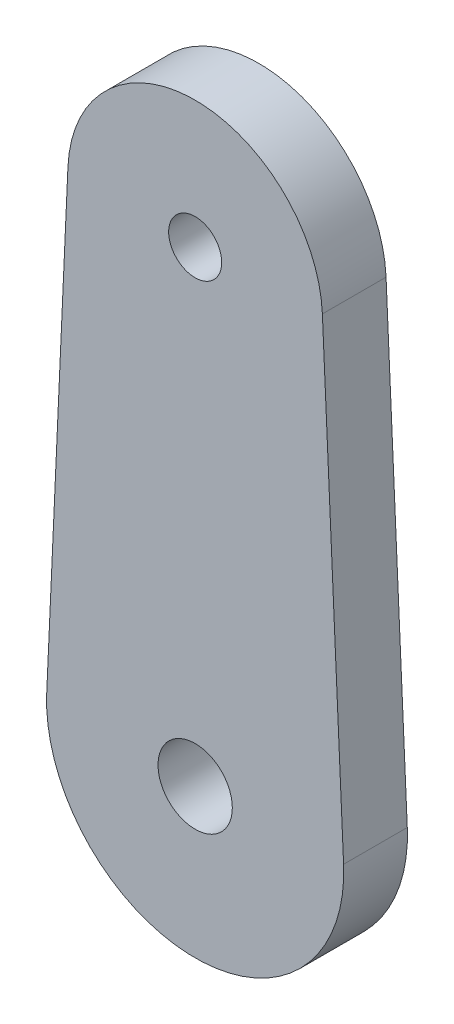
ISO-10303-21;
HEADER;
FILE_DESCRIPTION(('STEP AP214'),'2;1');
FILE_NAME('part.step','',(''),(''),'','','');
FILE_SCHEMA(('AUTOMOTIVE_DESIGN { 1 0 10303 214 1 1 1 1 }'));
ENDSEC;
DATA;
#1=APPLICATION_CONTEXT('core data for automotive mechanical design processes');
#2=APPLICATION_PROTOCOL_DEFINITION('international standard','automotive_design',2000,#1);
#3=PRODUCT_CONTEXT('',#1,'mechanical');
#4=PRODUCT('Part','Part','',(#3));
#5=PRODUCT_RELATED_PRODUCT_CATEGORY('part','',(#4));
#6=PRODUCT_DEFINITION_FORMATION('','',#4);
#7=PRODUCT_DEFINITION_CONTEXT('part definition',#1,'design');
#8=PRODUCT_DEFINITION('design','',#6,#7);
#9=PRODUCT_DEFINITION_SHAPE('','',#8);
#10=(LENGTH_UNIT() NAMED_UNIT(*) SI_UNIT(.MILLI.,.METRE.));
#11=(NAMED_UNIT(*) PLANE_ANGLE_UNIT() SI_UNIT($,.RADIAN.));
#12=(NAMED_UNIT(*) SI_UNIT($,.STERADIAN.) SOLID_ANGLE_UNIT());
#13=UNCERTAINTY_MEASURE_WITH_UNIT(LENGTH_MEASURE(1.E-05),#10,'distance_accuracy_value','');
#14=(GEOMETRIC_REPRESENTATION_CONTEXT(3) GLOBAL_UNCERTAINTY_ASSIGNED_CONTEXT((#13)) GLOBAL_UNIT_ASSIGNED_CONTEXT((#10,
#11,#12)) REPRESENTATION_CONTEXT('',''));
#15=CARTESIAN_POINT('',(0.,0.,0.));
#16=DIRECTION('',(0.,0.,1.));
#17=DIRECTION('',(1.,0.,0.));
#18=AXIS2_PLACEMENT_3D('',#15,#16,#17);
#19=CARTESIAN_POINT('',(0.,22.,3.));
#20=DIRECTION('',(0.,0.,1.));
#21=DIRECTION('',(1.,0.,0.));
#22=AXIS2_PLACEMENT_3D('',#19,#20,#21);
#23=PLANE('',#22);
#24=CARTESIAN_POINT('',(0.,22.,3.));
#25=DIRECTION('',(0.,0.,1.));
#26=DIRECTION('',(1.,0.,0.));
#27=AXIS2_PLACEMENT_3D('',#24,#25,#26);
#28=CIRCLE('',#27,1.24999999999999);
#29=CARTESIAN_POINT('',(1.24999999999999,22.,3.));
#30=VERTEX_POINT('',#29);
#31=EDGE_CURVE('E117',#30,#30,#28,.T.);
#32=ORIENTED_EDGE('',*,*,#31,.F.);
#33=EDGE_LOOP('',(#32));
#34=FACE_BOUND('',#33,.T.);
#35=CARTESIAN_POINT('',(0.,22.,3.));
#36=DIRECTION('',(0.,0.,1.));
#37=DIRECTION('',(1.,0.,0.));
#38=AXIS2_PLACEMENT_3D('',#35,#36,#37);
#39=CIRCLE('',#38,6.);
#40=CARTESIAN_POINT('',(5.99379844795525,22.2727272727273,3.));
#41=VERTEX_POINT('',#40);
#42=CARTESIAN_POINT('',(-5.99379844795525,22.2727272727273,3.));
#43=VERTEX_POINT('',#42);
#44=EDGE_CURVE('E82',#41,#43,#39,.T.);
#45=ORIENTED_EDGE('',*,*,#44,.T.);
#46=DIRECTION('',(-0.0454545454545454,-0.998966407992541,0.));
#47=VECTOR('',#46,1.);
#48=CARTESIAN_POINT('',(-5.99379844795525,22.2727272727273,3.));
#49=LINE('',#48,#47);
#50=CARTESIAN_POINT('',(-6.99276485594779,0.318181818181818,3.));
#51=VERTEX_POINT('',#50);
#52=EDGE_CURVE('E77',#43,#51,#49,.T.);
#53=ORIENTED_EDGE('',*,*,#52,.T.);
#54=CARTESIAN_POINT('',(0.,0.,3.));
#55=DIRECTION('',(0.,0.,1.));
#56=DIRECTION('',(1.,0.,0.));
#57=AXIS2_PLACEMENT_3D('',#54,#55,#56);
#58=CIRCLE('',#57,7.);
#59=CARTESIAN_POINT('',(6.99276485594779,0.318181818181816,3.));
#60=VERTEX_POINT('',#59);
#61=EDGE_CURVE('E80',#51,#60,#58,.T.);
#62=ORIENTED_EDGE('',*,*,#61,.T.);
#63=DIRECTION('',(-0.0454545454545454,0.998966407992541,0.));
#64=VECTOR('',#63,1.);
#65=CARTESIAN_POINT('',(5.99379844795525,22.2727272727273,3.));
#66=LINE('',#65,#64);
#67=EDGE_CURVE('E47',#60,#41,#66,.T.);
#68=ORIENTED_EDGE('',*,*,#67,.T.);
#69=EDGE_LOOP('',(#45,#53,#62,#68));
#70=FACE_BOUND('',#69,.T.);
#71=CARTESIAN_POINT('',(0.,0.,3.));
#72=DIRECTION('',(0.,0.,1.));
#73=DIRECTION('',(1.,0.,0.));
#74=AXIS2_PLACEMENT_3D('',#71,#72,#73);
#75=CIRCLE('',#74,1.75);
#76=CARTESIAN_POINT('',(1.75,0.,3.));
#77=VERTEX_POINT('',#76);
#78=EDGE_CURVE('E97',#77,#77,#75,.T.);
#79=ORIENTED_EDGE('',*,*,#78,.F.);
#80=EDGE_LOOP('',(#79));
#81=FACE_BOUND('',#80,.T.);
#82=ADVANCED_FACE('F30',(#34,#70,#81),#23,.T.);
#83=CARTESIAN_POINT('',(0.,22.,0.));
#84=DIRECTION('',(0.,0.,1.));
#85=DIRECTION('',(1.,0.,0.));
#86=AXIS2_PLACEMENT_3D('',#83,#84,#85);
#87=PLANE('',#86);
#88=CARTESIAN_POINT('',(0.,22.,0.));
#89=DIRECTION('',(0.,0.,1.));
#90=DIRECTION('',(1.,0.,0.));
#91=AXIS2_PLACEMENT_3D('',#88,#89,#90);
#92=CIRCLE('',#91,1.25);
#93=CARTESIAN_POINT('',(1.25,22.,0.));
#94=VERTEX_POINT('',#93);
#95=EDGE_CURVE('E112',#94,#94,#92,.T.);
#96=ORIENTED_EDGE('',*,*,#95,.T.);
#97=EDGE_LOOP('',(#96));
#98=FACE_BOUND('',#97,.T.);
#99=CARTESIAN_POINT('',(0.,22.,0.));
#100=DIRECTION('',(0.,0.,1.));
#101=DIRECTION('',(1.,0.,0.));
#102=AXIS2_PLACEMENT_3D('',#99,#100,#101);
#103=CIRCLE('',#102,6.);
#104=CARTESIAN_POINT('',(5.99379844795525,22.2727272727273,0.));
#105=VERTEX_POINT('',#104);
#106=CARTESIAN_POINT('',(-5.99379844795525,22.2727272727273,0.));
#107=VERTEX_POINT('',#106);
#108=EDGE_CURVE('E94',#105,#107,#103,.T.);
#109=ORIENTED_EDGE('',*,*,#108,.F.);
#110=DIRECTION('',(-0.0454545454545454,0.998966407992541,0.));
#111=VECTOR('',#110,1.);
#112=CARTESIAN_POINT('',(5.99379844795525,22.2727272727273,0.));
#113=LINE('',#112,#111);
#114=CARTESIAN_POINT('',(6.99276485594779,0.318181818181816,0.));
#115=VERTEX_POINT('',#114);
#116=EDGE_CURVE('E70',#115,#105,#113,.T.);
#117=ORIENTED_EDGE('',*,*,#116,.F.);
#118=CARTESIAN_POINT('',(0.,0.,0.));
#119=DIRECTION('',(0.,0.,1.));
#120=DIRECTION('',(1.,0.,0.));
#121=AXIS2_PLACEMENT_3D('',#118,#119,#120);
#122=CIRCLE('',#121,7.);
#123=CARTESIAN_POINT('',(-6.99276485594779,0.318181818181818,0.));
#124=VERTEX_POINT('',#123);
#125=EDGE_CURVE('E64',#124,#115,#122,.T.);
#126=ORIENTED_EDGE('',*,*,#125,.F.);
#127=DIRECTION('',(-0.0454545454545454,-0.998966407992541,0.));
#128=VECTOR('',#127,1.);
#129=CARTESIAN_POINT('',(-5.99379844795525,22.2727272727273,0.));
#130=LINE('',#129,#128);
#131=EDGE_CURVE('E86',#107,#124,#130,.T.);
#132=ORIENTED_EDGE('',*,*,#131,.F.);
#133=EDGE_LOOP('',(#109,#117,#126,#132));
#134=FACE_BOUND('',#133,.T.);
#135=CARTESIAN_POINT('',(0.,0.,0.));
#136=DIRECTION('',(0.,0.,1.));
#137=DIRECTION('',(1.,0.,0.));
#138=AXIS2_PLACEMENT_3D('',#135,#136,#137);
#139=CIRCLE('',#138,1.75);
#140=CARTESIAN_POINT('',(1.75,0.,0.));
#141=VERTEX_POINT('',#140);
#142=EDGE_CURVE('E109',#141,#141,#139,.T.);
#143=ORIENTED_EDGE('',*,*,#142,.T.);
#144=EDGE_LOOP('',(#143));
#145=FACE_BOUND('',#144,.T.);
#146=ADVANCED_FACE('F105',(#98,#134,#145),#87,.F.);
#147=CARTESIAN_POINT('',(0.,22.,3.));
#148=DIRECTION('',(0.,0.,-1.));
#149=DIRECTION('',(-1.,0.,0.));
#150=AXIS2_PLACEMENT_3D('',#147,#148,#149);
#151=CYLINDRICAL_SURFACE('',#150,6.);
#152=ORIENTED_EDGE('',*,*,#108,.T.);
#153=DIRECTION('',(0.,0.,-1.));
#154=VECTOR('',#153,1.);
#155=CARTESIAN_POINT('',(-5.99379844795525,22.2727272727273,3.));
#156=LINE('',#155,#154);
#157=EDGE_CURVE('E11',#43,#107,#156,.T.);
#158=ORIENTED_EDGE('',*,*,#157,.F.);
#159=ORIENTED_EDGE('',*,*,#44,.F.);
#160=DIRECTION('',(0.,0.,-1.));
#161=VECTOR('',#160,1.);
#162=CARTESIAN_POINT('',(5.99379844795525,22.2727272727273,3.));
#163=LINE('',#162,#161);
#164=EDGE_CURVE('E90',#41,#105,#163,.T.);
#165=ORIENTED_EDGE('',*,*,#164,.T.);
#166=EDGE_LOOP('',(#152,#158,#159,#165));
#167=FACE_BOUND('',#166,.T.);
#168=ADVANCED_FACE('F32',(#167),#151,.T.);
#169=CARTESIAN_POINT('',(-5.99379844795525,22.2727272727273,3.));
#170=DIRECTION('',(0.998966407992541,-0.0454545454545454,0.));
#171=DIRECTION('',(0.0454545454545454,0.998966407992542,0.));
#172=AXIS2_PLACEMENT_3D('',#169,#170,#171);
#173=PLANE('',#172);
#174=ORIENTED_EDGE('',*,*,#131,.T.);
#175=DIRECTION('',(0.,0.,-1.));
#176=VECTOR('',#175,1.);
#177=CARTESIAN_POINT('',(-6.99276485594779,0.318181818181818,3.));
#178=LINE('',#177,#176);
#179=EDGE_CURVE('E39',#51,#124,#178,.T.);
#180=ORIENTED_EDGE('',*,*,#179,.F.);
#181=ORIENTED_EDGE('',*,*,#52,.F.);
#182=ORIENTED_EDGE('',*,*,#157,.T.);
#183=EDGE_LOOP('',(#174,#180,#181,#182));
#184=FACE_BOUND('',#183,.T.);
#185=ADVANCED_FACE('F85',(#184),#173,.F.);
#186=CARTESIAN_POINT('',(0.,0.,3.));
#187=DIRECTION('',(0.,0.,-1.));
#188=DIRECTION('',(-1.,0.,0.));
#189=AXIS2_PLACEMENT_3D('',#186,#187,#188);
#190=CYLINDRICAL_SURFACE('',#189,7.);
#191=ORIENTED_EDGE('',*,*,#125,.T.);
#192=DIRECTION('',(0.,0.,-1.));
#193=VECTOR('',#192,1.);
#194=CARTESIAN_POINT('',(6.99276485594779,0.318181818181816,3.));
#195=LINE('',#194,#193);
#196=EDGE_CURVE('E87',#60,#115,#195,.T.);
#197=ORIENTED_EDGE('',*,*,#196,.F.);
#198=ORIENTED_EDGE('',*,*,#61,.F.);
#199=ORIENTED_EDGE('',*,*,#179,.T.);
#200=EDGE_LOOP('',(#191,#197,#198,#199));
#201=FACE_BOUND('',#200,.T.);
#202=ADVANCED_FACE('F88',(#201),#190,.T.);
#203=CARTESIAN_POINT('',(5.99379844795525,22.2727272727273,3.));
#204=DIRECTION('',(-0.998966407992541,-0.0454545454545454,0.));
#205=DIRECTION('',(0.0454545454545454,-0.998966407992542,0.));
#206=AXIS2_PLACEMENT_3D('',#203,#204,#205);
#207=PLANE('',#206);
#208=ORIENTED_EDGE('',*,*,#116,.T.);
#209=ORIENTED_EDGE('',*,*,#164,.F.);
#210=ORIENTED_EDGE('',*,*,#67,.F.);
#211=ORIENTED_EDGE('',*,*,#196,.T.);
#212=EDGE_LOOP('',(#208,#209,#210,#211));
#213=FACE_BOUND('',#212,.T.);
#214=ADVANCED_FACE('F102',(#213),#207,.F.);
#215=CARTESIAN_POINT('',(0.,0.,3.));
#216=DIRECTION('',(0.,0.,-1.));
#217=DIRECTION('',(-1.,0.,0.));
#218=AXIS2_PLACEMENT_3D('',#215,#216,#217);
#219=CYLINDRICAL_SURFACE('',#218,1.75);
#220=ORIENTED_EDGE('',*,*,#78,.T.);
#221=EDGE_LOOP('',(#220));
#222=FACE_BOUND('',#221,.T.);
#223=ORIENTED_EDGE('',*,*,#142,.F.);
#224=EDGE_LOOP('',(#223));
#225=FACE_BOUND('',#224,.T.);
#226=ADVANCED_FACE('F131',(#222,#225),#219,.F.);
#227=CARTESIAN_POINT('',(0.,22.,3.));
#228=DIRECTION('',(0.,0.,1.));
#229=DIRECTION('',(1.,0.,0.));
#230=AXIS2_PLACEMENT_3D('',#227,#228,#229);
#231=CYLINDRICAL_SURFACE('',#230,1.24999999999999);
#232=ORIENTED_EDGE('',*,*,#95,.F.);
#233=EDGE_LOOP('',(#232));
#234=FACE_BOUND('',#233,.T.);
#235=ORIENTED_EDGE('',*,*,#31,.T.);
#236=EDGE_LOOP('',(#235));
#237=FACE_BOUND('',#236,.T.);
#238=ADVANCED_FACE('F121',(#234,#237),#231,.F.);
#239=CLOSED_SHELL('',(#82,#146,#168,#185,#202,#214,#226,#238));
#240=MANIFOLD_SOLID_BREP('B2',#239);
#241=ADVANCED_BREP_SHAPE_REPRESENTATION('',(#18,#240),#14);
#242=SHAPE_DEFINITION_REPRESENTATION(#9,#241);
ENDSEC;
END-ISO-10303-21;
